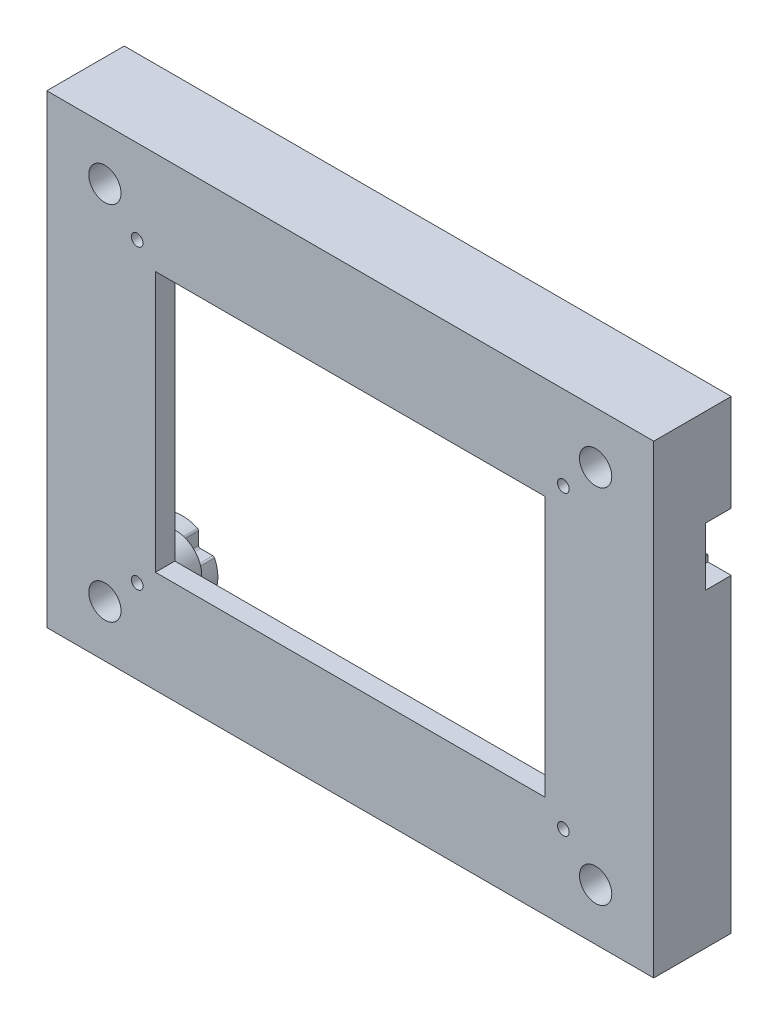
from build123d import *

# Parameters (mm, degrees)
SKETCH_1_W          = 94
SKETCH_1_H          = 72
SKETCH_1_R          = 1.65
EXTRUDE_1_DEPTH     = 12
SKETCH_2_R          = 2.5
CUT_EXTRUDE_1_DEPTH = 7.5
SKETCH_3_R          = 4
EXTRUDE_2_DEPTH     = 6
SKETCH_4_W          = 71
SKETCH_4_H          = 51
CUT_EXTRUDE_2_DEPTH = 6
FILLET_1_R          = 0.3
SKETCH_5_W          = 83.555555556
SKETCH_5_H          = 64
SKETCH_5_R          = 2.5
SKETCH_5_W_2        = 60.34314575
SKETCH_5_H_2        = 40.34314575
EXTRUDE_3_DEPTH     = 3
CUT_EXTRUDE_3_REACH = 61.506
SKETCH_6_R          = 0.9
SKETCH_7_W          = 4
SKETCH_7_H          = 9
CUT_EXTRUDE_4_DEPTH = 3.6
SKETCH_8_W          = 3
SKETCH_8_H          = 7
CUT_EXTRUDE_5_DEPTH = 3.6


with BuildPart() as part:
    # Sketch 1 → Extrude 1 (new body)
    with BuildSketch(Plane.XY):
        Rectangle(SKETCH_1_W, SKETCH_1_H)
        with Locations((-38, 28)):
            Circle(SKETCH_1_R, mode=Mode.SUBTRACT)
        with Locations((-38, -28)):
            Circle(SKETCH_1_R, mode=Mode.SUBTRACT)
        with Locations((38, 28)):
            Circle(SKETCH_1_R, mode=Mode.SUBTRACT)
        with Locations((38, -28)):
            Circle(SKETCH_1_R, mode=Mode.SUBTRACT)
        with BuildLine():
            Line((-34.225082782, 32), (34.225082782, 32))
            ThreePointArc((34.225082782, 32), (34.001350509, 24.223652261), (41.777777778, 24.00270153))
            Line((41.777777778, 24.00270153), (41.777777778, -24.00270153))
            ThreePointArc((41.777777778, -24.00270153), (34.001350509, -24.223652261), (34.225082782, -32))
            Line((34.225082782, -32), (-34.225082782, -32))
            ThreePointArc((-34.225082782, -32), (-34.001350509, -24.223652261), (-41.777777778, -24.00270153))
            Line((-41.777777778, -24.00270153), (-41.777777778, 24.00270153))
            ThreePointArc((-41.777777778, 24.00270153), (-34.001350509, 24.223652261), (-34.225082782, 32))
        make_face(mode=Mode.SUBTRACT)
        with BuildLine():
            Line((41.777777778, 32), (41.777777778, 31.99729847))
            ThreePointArc((41.777777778, 31.99729847), (41.776347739, 31.998649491), (41.774917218, 32))
            Line((41.774917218, 32), (41.777777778, 32))
        make_face(mode=Mode.SUBTRACT)
        with BuildLine():
            Line((41.777777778, -31.99729847), (41.777777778, -32))
            Line((41.777777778, -32), (41.774917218, -32))
            ThreePointArc((41.774917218, -32), (41.776347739, -31.998649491), (41.777777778, -31.99729847))
        make_face(mode=Mode.SUBTRACT)
    extrude(amount=EXTRUDE_1_DEPTH)

    # Sketch 2 → Cut-Extrude 1 (cut)
    with BuildSketch(Plane.XY.offset(12)):
        with Locations((-38, -28)):
            Circle(SKETCH_2_R)
        with Locations((-38, 28)):
            Circle(SKETCH_2_R)
        with Locations((38, 28)):
            Circle(SKETCH_2_R)
        with Locations((38, -28)):
            Circle(SKETCH_2_R)
    extrude(amount=-CUT_EXTRUDE_1_DEPTH, mode=Mode.SUBTRACT)

    # Sketch 3 → Extrude 2 (add)
    with BuildSketch(Plane.XY.offset(12)):
        with Locations((33, -23)):
            Circle(SKETCH_3_R)
        with Locations((-33, -23)):
            Circle(SKETCH_3_R)
        with Locations((-33, 23)):
            Circle(SKETCH_3_R)
        with Locations((33, 23)):
            Circle(SKETCH_3_R)
    extrude(amount=-EXTRUDE_2_DEPTH)

    # Sketch 4 → Cut-Extrude 2 (cut)
    with BuildSketch(Plane(origin=(0, 0, 0), x_dir=(-1, 0, 0), z_dir=(0, 0, -1))):
        Rectangle(SKETCH_4_W, SKETCH_4_H)
    extrude(amount=-CUT_EXTRUDE_2_DEPTH, mode=Mode.SUBTRACT)

    # Fillet 1
    fillet_1_edges = [part.edges().sort_by_distance(p)[0] for p in [
        (-33.101020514, -25.5, 3),
        (-35.5, -25.5, 3),
        (33.101020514, -25.5, 3),
        (-35.5, -23.101020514, 3),
        (-35.5, 23.101020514, 3),
        (-35.5, 25.5, 3),
        (-33.101020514, 25.5, 3),
        (33.101020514, 25.5, 3),
        (35.5, 25.5, 3),
        (35.5, 23.101020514, 3),
        (35.5, -23.101020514, 3),
        (35.5, -25.5, 3),
    ]]
    fillet(fillet_1_edges, radius=FILLET_1_R)

    # Sketch 5 → Extrude 3 (add)
    with BuildSketch(Plane.XY.offset(12)):
        Rectangle(SKETCH_5_W, SKETCH_5_H)
        with Locations((-38, 28)):
            Circle(SKETCH_5_R, mode=Mode.SUBTRACT)
        with Locations((-38, -28)):
            Circle(SKETCH_5_R, mode=Mode.SUBTRACT)
        with Locations((38, 28)):
            Circle(SKETCH_5_R, mode=Mode.SUBTRACT)
        with Locations((38, -28)):
            Circle(SKETCH_5_R, mode=Mode.SUBTRACT)
        Rectangle(SKETCH_5_W_2, SKETCH_5_H_2, mode=Mode.SUBTRACT)
    extrude(amount=-EXTRUDE_3_DEPTH)

    # Sketch 6 → Cut-Extrude 3 (cut, up to next)
    with BuildSketch(Plane(origin=(0, 0, 6), x_dir=(-1, 0, 0), z_dir=(0, 0, -1)), mode=Mode.PRIVATE) as cut_extrude_3_sk1:
        with Locations((33, 23)):
            Circle(SKETCH_6_R)
    cut_extrude_3_tool1 = extrude(cut_extrude_3_sk1.sketch, amount=-CUT_EXTRUDE_3_REACH, mode=Mode.PRIVATE) & part.part
    # Sketch 6 → Cut-Extrude 3 (cut, up to next)
    with BuildSketch(Plane(origin=(0, 0, 6), x_dir=(-1, 0, 0), z_dir=(0, 0, -1)), mode=Mode.PRIVATE) as cut_extrude_3_sk2:
        with Locations((-33, 23)):
            Circle(SKETCH_6_R)
    cut_extrude_3_tool2 = extrude(cut_extrude_3_sk2.sketch, amount=-CUT_EXTRUDE_3_REACH, mode=Mode.PRIVATE) & part.part
    # Sketch 6 → Cut-Extrude 3 (cut, up to next)
    with BuildSketch(Plane(origin=(0, 0, 6), x_dir=(-1, 0, 0), z_dir=(0, 0, -1)), mode=Mode.PRIVATE) as cut_extrude_3_sk3:
        with Locations((-33, -23)):
            Circle(SKETCH_6_R)
    cut_extrude_3_tool3 = extrude(cut_extrude_3_sk3.sketch, amount=-CUT_EXTRUDE_3_REACH, mode=Mode.PRIVATE) & part.part
    # Sketch 6 → Cut-Extrude 3 (cut, up to next)
    with BuildSketch(Plane(origin=(0, 0, 6), x_dir=(-1, 0, 0), z_dir=(0, 0, -1)), mode=Mode.PRIVATE) as cut_extrude_3_sk4:
        with Locations((33, -23)):
            Circle(SKETCH_6_R)
    cut_extrude_3_tool4 = extrude(cut_extrude_3_sk4.sketch, amount=-CUT_EXTRUDE_3_REACH, mode=Mode.PRIVATE) & part.part
    add(cut_extrude_3_tool1.solids().sort_by_distance((-33, 23, 6))[0], mode=Mode.SUBTRACT)
    add(cut_extrude_3_tool2.solids().sort_by_distance((33, 23, 6))[0], mode=Mode.SUBTRACT)
    add(cut_extrude_3_tool3.solids().sort_by_distance((33, -23, 6))[0], mode=Mode.SUBTRACT)
    add(cut_extrude_3_tool4.solids().sort_by_distance((-33, -23, 6))[0], mode=Mode.SUBTRACT)

    # Sketch 7 → Cut-Extrude 4 (cut)
    with BuildSketch(Plane(origin=(47, 0, 0), x_dir=(0, 0, -1), z_dir=(1, 0, 0))):
        with Locations((-2, 16.5)):
            Rectangle(SKETCH_7_W, SKETCH_7_H)
    extrude(amount=-CUT_EXTRUDE_4_DEPTH, mode=Mode.SUBTRACT)

    # Sketch 8 → Cut-Extrude 5 (cut)
    with BuildSketch(Plane(origin=(43.4, 0, 0), x_dir=(0, 0, -1), z_dir=(1, 0, 0))):
        with Locations((-1.5, 16.5)):
            Rectangle(SKETCH_8_W, SKETCH_8_H)
    extrude(amount=-CUT_EXTRUDE_5_DEPTH, mode=Mode.SUBTRACT)


solid = part.part
